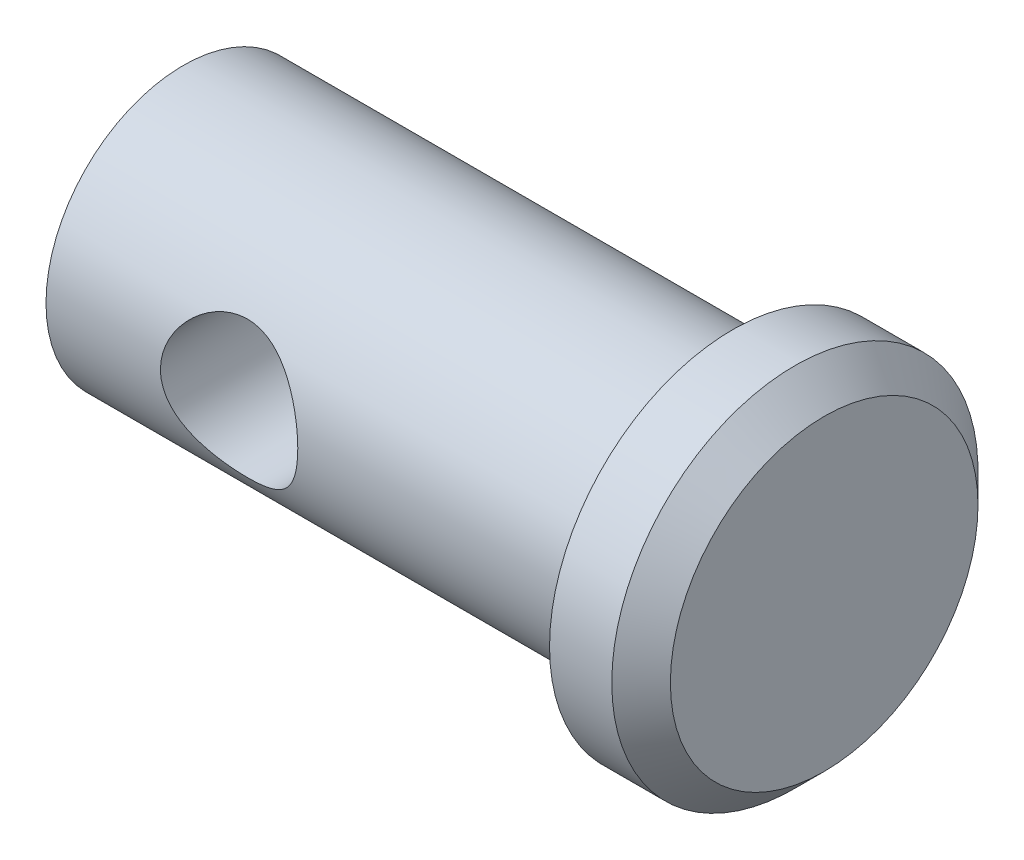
ISO-10303-21;
HEADER;
FILE_DESCRIPTION(('STEP AP214'),'2;1');
FILE_NAME('part.step','',(''),(''),'','','');
FILE_SCHEMA(('AUTOMOTIVE_DESIGN { 1 0 10303 214 1 1 1 1 }'));
ENDSEC;
DATA;
#1=APPLICATION_CONTEXT('core data for automotive mechanical design processes');
#2=APPLICATION_PROTOCOL_DEFINITION('international standard','automotive_design',2000,#1);
#3=PRODUCT_CONTEXT('',#1,'mechanical');
#4=PRODUCT('Part','Part','',(#3));
#5=PRODUCT_RELATED_PRODUCT_CATEGORY('part','',(#4));
#6=PRODUCT_DEFINITION_FORMATION('','',#4);
#7=PRODUCT_DEFINITION_CONTEXT('part definition',#1,'design');
#8=PRODUCT_DEFINITION('design','',#6,#7);
#9=PRODUCT_DEFINITION_SHAPE('','',#8);
#10=(LENGTH_UNIT() NAMED_UNIT(*) SI_UNIT(.MILLI.,.METRE.));
#11=(NAMED_UNIT(*) PLANE_ANGLE_UNIT() SI_UNIT($,.RADIAN.));
#12=(NAMED_UNIT(*) SI_UNIT($,.STERADIAN.) SOLID_ANGLE_UNIT());
#13=UNCERTAINTY_MEASURE_WITH_UNIT(LENGTH_MEASURE(1.E-05),#10,'distance_accuracy_value','');
#14=(GEOMETRIC_REPRESENTATION_CONTEXT(3) GLOBAL_UNCERTAINTY_ASSIGNED_CONTEXT((#13)) GLOBAL_UNIT_ASSIGNED_CONTEXT((#10,
#11,#12)) REPRESENTATION_CONTEXT('',''));
#15=CARTESIAN_POINT('',(0.,0.,0.));
#16=DIRECTION('',(0.,0.,1.));
#17=DIRECTION('',(1.,0.,0.));
#18=AXIS2_PLACEMENT_3D('',#15,#16,#17);
#19=CARTESIAN_POINT('',(0.,0.,0.));
#20=DIRECTION('',(1.,0.,0.));
#21=DIRECTION('',(0.,0.,-1.));
#22=AXIS2_PLACEMENT_3D('',#19,#20,#21);
#23=PLANE('',#22);
#24=CARTESIAN_POINT('',(0.,0.,0.));
#25=DIRECTION('',(-1.,0.,0.));
#26=DIRECTION('',(0.,0.,1.));
#27=AXIS2_PLACEMENT_3D('',#24,#25,#26);
#28=CIRCLE('',#27,2.38125);
#29=CARTESIAN_POINT('',(0.,0.,2.38125));
#30=VERTEX_POINT('',#29);
#31=EDGE_CURVE('E47',#30,#30,#28,.T.);
#32=ORIENTED_EDGE('',*,*,#31,.T.);
#33=EDGE_LOOP('',(#32));
#34=FACE_BOUND('',#33,.T.);
#35=ADVANCED_FACE('F32',(#34),#23,.F.);
#36=CARTESIAN_POINT('',(0.,0.,0.));
#37=DIRECTION('',(-1.,0.,0.));
#38=DIRECTION('',(0.,0.,1.));
#39=AXIS2_PLACEMENT_3D('',#36,#37,#38);
#40=CYLINDRICAL_SURFACE('',#39,2.38125);
#41=CARTESIAN_POINT('',(4.365625,0.,2.38125));
#42=CARTESIAN_POINT('',(4.36562106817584,-0.0625934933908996,2.38124658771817));
#43=CARTESIAN_POINT('',(4.36066000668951,-0.12526160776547,2.37875553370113));
#44=CARTESIAN_POINT('',(4.34103516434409,-0.248745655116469,2.36903604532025));
#45=CARTESIAN_POINT('',(4.32635295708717,-0.309557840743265,2.36179861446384));
#46=CARTESIAN_POINT('',(4.28800362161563,-0.427355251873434,2.34334382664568));
#47=CARTESIAN_POINT('',(4.26437141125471,-0.484354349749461,2.33214194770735));
#48=CARTESIAN_POINT('',(4.20897372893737,-0.593493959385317,2.30678565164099));
#49=CARTESIAN_POINT('',(4.17720889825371,-0.645634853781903,2.29263146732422));
#50=CARTESIAN_POINT('',(4.10426227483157,-0.747126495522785,2.26166669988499));
#51=CARTESIAN_POINT('',(4.0626270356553,-0.796117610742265,2.24474721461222));
#52=CARTESIAN_POINT('',(3.9720978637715,-0.886753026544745,2.2105140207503));
#53=CARTESIAN_POINT('',(3.92319845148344,-0.928391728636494,2.19320002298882));
#54=CARTESIAN_POINT('',(3.81498076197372,-1.00637816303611,2.15859063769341));
#55=CARTESIAN_POINT('',(3.7551485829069,-1.04206516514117,2.14140081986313));
#56=CARTESIAN_POINT('',(3.62938139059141,-1.10271904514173,2.11081118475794));
#57=CARTESIAN_POINT('',(3.56345077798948,-1.12769358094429,2.09740866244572));
#58=CARTESIAN_POINT('',(3.43138310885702,-1.16458893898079,2.07713897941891));
#59=CARTESIAN_POINT('',(3.36549469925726,-1.1772017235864,2.06992860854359));
#60=CARTESIAN_POINT('',(3.23217519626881,-1.19113338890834,2.06194687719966));
#61=CARTESIAN_POINT('',(3.16474569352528,-1.19246343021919,2.06116915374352));
#62=CARTESIAN_POINT('',(3.03892820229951,-1.18429955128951,2.06586451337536));
#63=CARTESIAN_POINT('',(2.98042326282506,-1.17608099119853,2.07060121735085));
#64=CARTESIAN_POINT('',(2.86576860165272,-1.15126275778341,2.0845013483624));
#65=CARTESIAN_POINT('',(2.80961963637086,-1.13466041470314,2.09366618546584));
#66=CARTESIAN_POINT('',(2.69966781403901,-1.09324351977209,2.1155915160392));
#67=CARTESIAN_POINT('',(2.64595006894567,-1.06824668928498,2.12843079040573));
#68=CARTESIAN_POINT('',(2.54321354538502,-1.01089025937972,2.15626240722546));
#69=CARTESIAN_POINT('',(2.49419689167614,-0.97852735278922,2.17125571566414));
#70=CARTESIAN_POINT('',(2.3957106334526,-0.902572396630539,2.204003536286));
#71=CARTESIAN_POINT('',(2.34697165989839,-0.858076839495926,2.22186710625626));
#72=CARTESIAN_POINT('',(2.25734314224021,-0.761470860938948,2.25680138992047));
#73=CARTESIAN_POINT('',(2.21645734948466,-0.709356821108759,2.27387172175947));
#74=CARTESIAN_POINT('',(2.14191175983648,-0.595927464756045,2.30626428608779));
#75=CARTESIAN_POINT('',(2.10867568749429,-0.534297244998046,2.3214685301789));
#76=CARTESIAN_POINT('',(2.05331572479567,-0.405367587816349,2.34741102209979));
#77=CARTESIAN_POINT('',(2.03118301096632,-0.338072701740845,2.35815281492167));
#78=CARTESIAN_POINT('',(2.00047772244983,-0.205700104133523,2.37320534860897));
#79=CARTESIAN_POINT('',(1.99093387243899,-0.140900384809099,2.37797504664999));
#80=CARTESIAN_POINT('',(1.982631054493,-0.0104532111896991,2.38211931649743));
#81=CARTESIAN_POINT('',(1.98386697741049,0.0551938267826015,2.38149644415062));
#82=CARTESIAN_POINT('',(1.99652733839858,0.180061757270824,2.37519200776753));
#83=CARTESIAN_POINT('',(2.00715467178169,0.239386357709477,2.36990626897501));
#84=CARTESIAN_POINT('',(2.03704595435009,0.35529070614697,2.35532022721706));
#85=CARTESIAN_POINT('',(2.05631085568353,0.411870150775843,2.34601948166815));
#86=CARTESIAN_POINT('',(2.103435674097,0.522551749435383,2.323912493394));
#87=CARTESIAN_POINT('',(2.13152559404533,0.576536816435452,2.31101362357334));
#88=CARTESIAN_POINT('',(2.19524365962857,0.679205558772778,2.28295169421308));
#89=CARTESIAN_POINT('',(2.2308750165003,0.727886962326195,2.26778767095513));
#90=CARTESIAN_POINT('',(2.31270225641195,0.823635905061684,2.23490101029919));
#91=CARTESIAN_POINT('',(2.35959197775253,0.870075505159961,2.21707334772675));
#92=CARTESIAN_POINT('',(2.46053588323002,0.954710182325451,2.18196785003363));
#93=CARTESIAN_POINT('',(2.51459498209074,0.992899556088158,2.1646904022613));
#94=CARTESIAN_POINT('',(2.63165072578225,1.06168973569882,2.13182825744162));
#95=CARTESIAN_POINT('',(2.69495341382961,1.0918334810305,2.11636605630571));
#96=CARTESIAN_POINT('',(2.82675417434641,1.14071736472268,2.090428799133));
#97=CARTESIAN_POINT('',(2.89524542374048,1.15947219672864,2.07994732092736));
#98=CARTESIAN_POINT('',(3.02844623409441,1.18331657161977,2.06646662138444));
#99=CARTESIAN_POINT('',(3.09288765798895,1.18954509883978,2.06284572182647));
#100=CARTESIAN_POINT('',(3.22196666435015,1.19144552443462,2.06175000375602));
#101=CARTESIAN_POINT('',(3.28660414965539,1.18712199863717,2.06427252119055));
#102=CARTESIAN_POINT('',(3.40774754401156,1.16910579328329,2.07451954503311));
#103=CARTESIAN_POINT('',(3.46444149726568,1.1563448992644,2.081725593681));
#104=CARTESIAN_POINT('',(3.57482154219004,1.12296816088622,2.09991741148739));
#105=CARTESIAN_POINT('',(3.62850665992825,1.10234978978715,2.11090439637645));
#106=CARTESIAN_POINT('',(3.73533771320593,1.05229312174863,2.13632093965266));
#107=CARTESIAN_POINT('',(3.78820509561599,1.02235532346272,2.15093219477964));
#108=CARTESIAN_POINT('',(3.88851124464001,0.955061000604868,2.18164566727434));
#109=CARTESIAN_POINT('',(3.93594716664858,0.917700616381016,2.19774865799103));
#110=CARTESIAN_POINT('',(4.03003779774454,0.831298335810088,2.23197328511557));
#111=CARTESIAN_POINT('',(4.07589724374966,0.781388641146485,2.25010245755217));
#112=CARTESIAN_POINT('',(4.15876936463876,0.67407806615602,2.28454448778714));
#113=CARTESIAN_POINT('',(4.19577727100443,0.616673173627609,2.30085636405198));
#114=CARTESIAN_POINT('',(4.25994079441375,0.495218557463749,2.33002942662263));
#115=CARTESIAN_POINT('',(4.28702490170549,0.43112472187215,2.34286539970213));
#116=CARTESIAN_POINT('',(4.3296778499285,0.298539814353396,2.36340659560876));
#117=CARTESIAN_POINT('',(4.34527941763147,0.230061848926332,2.37112639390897));
#118=CARTESIAN_POINT('',(4.35835910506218,0.134066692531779,2.37762409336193));
#119=CARTESIAN_POINT('',(4.36107995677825,0.107348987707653,2.37898025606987));
#120=CARTESIAN_POINT('',(4.36471377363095,0.0537587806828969,2.3807939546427));
#121=CARTESIAN_POINT('',(4.36562668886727,0.0268862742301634,2.38125146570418));
#122=CARTESIAN_POINT('',(4.365625,0.,2.38125));
#123=B_SPLINE_CURVE_WITH_KNOTS('',3,(#41,#42,#43,#44,#45,#46,#47,#48,#49,#50,#51,#52,#53,#54,
#55,#56,#57,#58,#59,#60,#61,#62,#63,#64,#65,#66,#67,#68,#69,#70,#71,#72,#73,#74,#75,#76,#77,#78,
#79,#80,#81,#82,#83,#84,#85,#86,#87,#88,#89,#90,#91,#92,#93,#94,#95,#96,#97,#98,#99,#100,#101,
#102,#103,#104,#105,#106,#107,#108,#109,#110,#111,#112,#113,#114,#115,#116,#117,#118,#119,#120,
#121,#122),.UNSPECIFIED.,.T.,.F.,(4,2,2,2,2,2,2,2,2,2,2,2,2,2,2,2,2,2,2,2,2,2,2,2,2,2,2,2,2,2,2,
2,2,2,2,2,2,2,2,2,4),(0.,0.187671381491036,0.375699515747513,0.563001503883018,
0.750288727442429,0.948906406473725,1.14767467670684,1.36185743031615,1.57588681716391,
1.77710320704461,1.97812053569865,2.15509926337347,2.33213438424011,2.51329317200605,
2.69453345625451,2.89875445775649,3.10307277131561,3.31687910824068,3.53051527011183,
3.72645730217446,3.92230647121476,4.10297598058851,4.28366541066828,4.46952119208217,
4.65545627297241,4.85965036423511,5.06398516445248,5.27821543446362,5.49216872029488,
5.68558331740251,5.87891405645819,6.0538272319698,6.22879670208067,6.41552156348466,
6.60234377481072,6.81186617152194,7.02150118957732,7.2326184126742,7.44313156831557,
7.52374130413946,7.60435326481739),.UNSPECIFIED.);
#124=CARTESIAN_POINT('',(4.365625,0.,2.38125));
#125=VERTEX_POINT('',#124);
#126=EDGE_CURVE('E35',#125,#125,#123,.T.);
#127=ORIENTED_EDGE('',*,*,#126,.T.);
#128=EDGE_LOOP('',(#127));
#129=FACE_BOUND('',#128,.T.);
#130=CARTESIAN_POINT('',(4.365625,0.,-2.38125));
#131=CARTESIAN_POINT('',(4.36562106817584,0.0625934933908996,-2.38124658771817));
#132=CARTESIAN_POINT('',(4.36066000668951,0.12526160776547,-2.37875553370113));
#133=CARTESIAN_POINT('',(4.34103516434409,0.248745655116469,-2.36903604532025));
#134=CARTESIAN_POINT('',(4.32635295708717,0.309557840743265,-2.36179861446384));
#135=CARTESIAN_POINT('',(4.28800362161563,0.427355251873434,-2.34334382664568));
#136=CARTESIAN_POINT('',(4.26437141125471,0.484354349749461,-2.33214194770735));
#137=CARTESIAN_POINT('',(4.20897372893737,0.593493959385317,-2.30678565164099));
#138=CARTESIAN_POINT('',(4.17720889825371,0.645634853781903,-2.29263146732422));
#139=CARTESIAN_POINT('',(4.10426227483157,0.747126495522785,-2.26166669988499));
#140=CARTESIAN_POINT('',(4.0626270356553,0.796117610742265,-2.24474721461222));
#141=CARTESIAN_POINT('',(3.9720978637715,0.886753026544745,-2.2105140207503));
#142=CARTESIAN_POINT('',(3.92319845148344,0.928391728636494,-2.19320002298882));
#143=CARTESIAN_POINT('',(3.81498076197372,1.00637816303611,-2.15859063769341));
#144=CARTESIAN_POINT('',(3.7551485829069,1.04206516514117,-2.14140081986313));
#145=CARTESIAN_POINT('',(3.62938139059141,1.10271904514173,-2.11081118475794));
#146=CARTESIAN_POINT('',(3.56345077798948,1.12769358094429,-2.09740866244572));
#147=CARTESIAN_POINT('',(3.43138310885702,1.16458893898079,-2.07713897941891));
#148=CARTESIAN_POINT('',(3.36549469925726,1.1772017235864,-2.06992860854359));
#149=CARTESIAN_POINT('',(3.23217519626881,1.19113338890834,-2.06194687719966));
#150=CARTESIAN_POINT('',(3.16474569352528,1.19246343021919,-2.06116915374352));
#151=CARTESIAN_POINT('',(3.03892820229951,1.18429955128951,-2.06586451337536));
#152=CARTESIAN_POINT('',(2.98042326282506,1.17608099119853,-2.07060121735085));
#153=CARTESIAN_POINT('',(2.86576860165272,1.15126275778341,-2.0845013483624));
#154=CARTESIAN_POINT('',(2.80961963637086,1.13466041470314,-2.09366618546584));
#155=CARTESIAN_POINT('',(2.69966781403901,1.09324351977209,-2.1155915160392));
#156=CARTESIAN_POINT('',(2.64595006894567,1.06824668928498,-2.12843079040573));
#157=CARTESIAN_POINT('',(2.54321354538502,1.01089025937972,-2.15626240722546));
#158=CARTESIAN_POINT('',(2.49419689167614,0.97852735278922,-2.17125571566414));
#159=CARTESIAN_POINT('',(2.3957106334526,0.902572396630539,-2.204003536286));
#160=CARTESIAN_POINT('',(2.34697165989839,0.858076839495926,-2.22186710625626));
#161=CARTESIAN_POINT('',(2.25734314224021,0.761470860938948,-2.25680138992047));
#162=CARTESIAN_POINT('',(2.21645734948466,0.709356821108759,-2.27387172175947));
#163=CARTESIAN_POINT('',(2.14191175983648,0.595927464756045,-2.30626428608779));
#164=CARTESIAN_POINT('',(2.10867568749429,0.534297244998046,-2.3214685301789));
#165=CARTESIAN_POINT('',(2.05331572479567,0.405367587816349,-2.34741102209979));
#166=CARTESIAN_POINT('',(2.03118301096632,0.338072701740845,-2.35815281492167));
#167=CARTESIAN_POINT('',(2.00047772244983,0.205700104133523,-2.37320534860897));
#168=CARTESIAN_POINT('',(1.99093387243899,0.140900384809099,-2.37797504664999));
#169=CARTESIAN_POINT('',(1.982631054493,0.0104532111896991,-2.38211931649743));
#170=CARTESIAN_POINT('',(1.98386697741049,-0.0551938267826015,-2.38149644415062));
#171=CARTESIAN_POINT('',(1.99652733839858,-0.180061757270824,-2.37519200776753));
#172=CARTESIAN_POINT('',(2.00715467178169,-0.239386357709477,-2.36990626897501));
#173=CARTESIAN_POINT('',(2.03704595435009,-0.35529070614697,-2.35532022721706));
#174=CARTESIAN_POINT('',(2.05631085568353,-0.411870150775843,-2.34601948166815));
#175=CARTESIAN_POINT('',(2.103435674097,-0.522551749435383,-2.323912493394));
#176=CARTESIAN_POINT('',(2.13152559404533,-0.576536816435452,-2.31101362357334));
#177=CARTESIAN_POINT('',(2.19524365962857,-0.679205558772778,-2.28295169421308));
#178=CARTESIAN_POINT('',(2.2308750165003,-0.727886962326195,-2.26778767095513));
#179=CARTESIAN_POINT('',(2.31270225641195,-0.823635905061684,-2.23490101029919));
#180=CARTESIAN_POINT('',(2.35959197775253,-0.870075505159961,-2.21707334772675));
#181=CARTESIAN_POINT('',(2.46053588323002,-0.954710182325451,-2.18196785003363));
#182=CARTESIAN_POINT('',(2.51459498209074,-0.992899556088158,-2.1646904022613));
#183=CARTESIAN_POINT('',(2.63165072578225,-1.06168973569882,-2.13182825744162));
#184=CARTESIAN_POINT('',(2.69495341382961,-1.0918334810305,-2.11636605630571));
#185=CARTESIAN_POINT('',(2.82675417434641,-1.14071736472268,-2.090428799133));
#186=CARTESIAN_POINT('',(2.89524542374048,-1.15947219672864,-2.07994732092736));
#187=CARTESIAN_POINT('',(3.02844623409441,-1.18331657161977,-2.06646662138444));
#188=CARTESIAN_POINT('',(3.09288765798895,-1.18954509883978,-2.06284572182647));
#189=CARTESIAN_POINT('',(3.22196666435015,-1.19144552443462,-2.06175000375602));
#190=CARTESIAN_POINT('',(3.28660414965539,-1.18712199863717,-2.06427252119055));
#191=CARTESIAN_POINT('',(3.40774754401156,-1.16910579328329,-2.07451954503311));
#192=CARTESIAN_POINT('',(3.46444149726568,-1.1563448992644,-2.081725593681));
#193=CARTESIAN_POINT('',(3.57482154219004,-1.12296816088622,-2.09991741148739));
#194=CARTESIAN_POINT('',(3.62850665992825,-1.10234978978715,-2.11090439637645));
#195=CARTESIAN_POINT('',(3.73533771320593,-1.05229312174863,-2.13632093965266));
#196=CARTESIAN_POINT('',(3.78820509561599,-1.02235532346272,-2.15093219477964));
#197=CARTESIAN_POINT('',(3.88851124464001,-0.955061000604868,-2.18164566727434));
#198=CARTESIAN_POINT('',(3.93594716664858,-0.917700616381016,-2.19774865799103));
#199=CARTESIAN_POINT('',(4.03003779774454,-0.831298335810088,-2.23197328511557));
#200=CARTESIAN_POINT('',(4.07589724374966,-0.781388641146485,-2.25010245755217));
#201=CARTESIAN_POINT('',(4.15876936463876,-0.67407806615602,-2.28454448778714));
#202=CARTESIAN_POINT('',(4.19577727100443,-0.616673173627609,-2.30085636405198));
#203=CARTESIAN_POINT('',(4.25994079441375,-0.495218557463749,-2.33002942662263));
#204=CARTESIAN_POINT('',(4.28702490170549,-0.43112472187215,-2.34286539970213));
#205=CARTESIAN_POINT('',(4.3296778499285,-0.298539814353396,-2.36340659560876));
#206=CARTESIAN_POINT('',(4.34527941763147,-0.230061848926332,-2.37112639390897));
#207=CARTESIAN_POINT('',(4.35835910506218,-0.134066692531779,-2.37762409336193));
#208=CARTESIAN_POINT('',(4.36107995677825,-0.107348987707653,-2.37898025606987));
#209=CARTESIAN_POINT('',(4.36471377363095,-0.0537587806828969,-2.3807939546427));
#210=CARTESIAN_POINT('',(4.36562668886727,-0.0268862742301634,-2.38125146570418));
#211=CARTESIAN_POINT('',(4.365625,0.,-2.38125));
#212=B_SPLINE_CURVE_WITH_KNOTS('',3,(#130,#131,#132,#133,#134,#135,#136,#137,#138,#139,#140,
#141,#142,#143,#144,#145,#146,#147,#148,#149,#150,#151,#152,#153,#154,#155,#156,#157,#158,#159,
#160,#161,#162,#163,#164,#165,#166,#167,#168,#169,#170,#171,#172,#173,#174,#175,#176,#177,#178,
#179,#180,#181,#182,#183,#184,#185,#186,#187,#188,#189,#190,#191,#192,#193,#194,#195,#196,#197,
#198,#199,#200,#201,#202,#203,#204,#205,#206,#207,#208,#209,#210,#211),.UNSPECIFIED.,.T.,.F.,(4,
2,2,2,2,2,2,2,2,2,2,2,2,2,2,2,2,2,2,2,2,2,2,2,2,2,2,2,2,2,2,2,2,2,2,2,2,2,2,2,4),(0.,
0.187671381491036,0.375699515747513,0.563001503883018,0.750288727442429,0.948906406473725,
1.14767467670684,1.36185743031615,1.57588681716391,1.77710320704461,1.97812053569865,
2.15509926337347,2.33213438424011,2.51329317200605,2.69453345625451,2.89875445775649,
3.10307277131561,3.31687910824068,3.53051527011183,3.72645730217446,3.92230647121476,
4.10297598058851,4.28366541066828,4.46952119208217,4.65545627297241,4.85965036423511,
5.06398516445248,5.27821543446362,5.49216872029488,5.68558331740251,5.87891405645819,
6.0538272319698,6.22879670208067,6.41552156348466,6.60234377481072,6.81186617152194,
7.02150118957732,7.2326184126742,7.44313156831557,7.52374130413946,7.60435326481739),.UNSPECIFIED.);
#213=CARTESIAN_POINT('',(4.365625,0.,-2.38125));
#214=VERTEX_POINT('',#213);
#215=EDGE_CURVE('E50',#214,#214,#212,.T.);
#216=ORIENTED_EDGE('',*,*,#215,.T.);
#217=EDGE_LOOP('',(#216));
#218=FACE_BOUND('',#217,.T.);
#219=ORIENTED_EDGE('',*,*,#31,.F.);
#220=EDGE_LOOP('',(#219));
#221=FACE_BOUND('',#220,.T.);
#222=CARTESIAN_POINT('',(9.525,0.,0.));
#223=DIRECTION('',(-1.,0.,0.));
#224=DIRECTION('',(0.,0.,1.));
#225=AXIS2_PLACEMENT_3D('',#222,#223,#224);
#226=CIRCLE('',#225,2.38125);
#227=CARTESIAN_POINT('',(9.525,0.,2.38125));
#228=VERTEX_POINT('',#227);
#229=EDGE_CURVE('E89',#228,#228,#226,.T.);
#230=ORIENTED_EDGE('',*,*,#229,.T.);
#231=EDGE_LOOP('',(#230));
#232=FACE_BOUND('',#231,.T.);
#233=ADVANCED_FACE('F54',(#129,#218,#221,#232),#40,.T.);
#234=CARTESIAN_POINT('',(9.525,2.38125,0.));
#235=DIRECTION('',(1.,0.,0.));
#236=DIRECTION('',(0.,0.,-1.));
#237=AXIS2_PLACEMENT_3D('',#234,#235,#236);
#238=PLANE('',#237);
#239=ORIENTED_EDGE('',*,*,#229,.F.);
#240=EDGE_LOOP('',(#239));
#241=FACE_BOUND('',#240,.T.);
#242=CARTESIAN_POINT('',(9.525,0.,0.));
#243=DIRECTION('',(-1.,0.,0.));
#244=DIRECTION('',(0.,0.,1.));
#245=AXIS2_PLACEMENT_3D('',#242,#243,#244);
#246=CIRCLE('',#245,3.175);
#247=CARTESIAN_POINT('',(9.525,0.,3.175));
#248=VERTEX_POINT('',#247);
#249=EDGE_CURVE('E91',#248,#248,#246,.T.);
#250=ORIENTED_EDGE('',*,*,#249,.T.);
#251=EDGE_LOOP('',(#250));
#252=FACE_BOUND('',#251,.T.);
#253=ADVANCED_FACE('F72',(#241,#252),#238,.F.);
#254=CARTESIAN_POINT('',(0.,0.,0.));
#255=DIRECTION('',(-1.,0.,0.));
#256=DIRECTION('',(0.,0.,1.));
#257=AXIS2_PLACEMENT_3D('',#254,#255,#256);
#258=CYLINDRICAL_SURFACE('',#257,3.175);
#259=CARTESIAN_POINT('',(10.6045,0.,0.));
#260=DIRECTION('',(-1.,0.,0.));
#261=DIRECTION('',(0.,0.,1.));
#262=AXIS2_PLACEMENT_3D('',#259,#260,#261);
#263=CIRCLE('',#262,3.175);
#264=CARTESIAN_POINT('',(10.6045,0.,3.175));
#265=VERTEX_POINT('',#264);
#266=EDGE_CURVE('E42',#265,#265,#263,.T.);
#267=ORIENTED_EDGE('',*,*,#266,.T.);
#268=EDGE_LOOP('',(#267));
#269=FACE_BOUND('',#268,.T.);
#270=ORIENTED_EDGE('',*,*,#249,.F.);
#271=EDGE_LOOP('',(#270));
#272=FACE_BOUND('',#271,.T.);
#273=ADVANCED_FACE('F70',(#269,#272),#258,.T.);
#274=CARTESIAN_POINT('',(11.1125,3.175,0.));
#275=DIRECTION('',(-1.,0.,0.));
#276=DIRECTION('',(0.,0.,1.));
#277=AXIS2_PLACEMENT_3D('',#274,#275,#276);
#278=PLANE('',#277);
#279=CARTESIAN_POINT('',(11.1125,0.,0.));
#280=DIRECTION('',(-1.,0.,0.));
#281=DIRECTION('',(0.,0.,1.));
#282=AXIS2_PLACEMENT_3D('',#279,#280,#281);
#283=CIRCLE('',#282,2.667);
#284=CARTESIAN_POINT('',(11.1125,0.,2.667));
#285=VERTEX_POINT('',#284);
#286=EDGE_CURVE('E10',#285,#285,#283,.F.);
#287=ORIENTED_EDGE('',*,*,#286,.T.);
#288=EDGE_LOOP('',(#287));
#289=FACE_BOUND('',#288,.T.);
#290=ADVANCED_FACE('F66',(#289),#278,.F.);
#291=CARTESIAN_POINT('',(10.6045,0.,0.));
#292=DIRECTION('',(-1.,0.,0.));
#293=DIRECTION('',(0.,0.,1.));
#294=AXIS2_PLACEMENT_3D('',#291,#292,#293);
#295=CONICAL_SURFACE('',#294,3.175,0.785398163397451);
#296=ORIENTED_EDGE('',*,*,#286,.F.);
#297=EDGE_LOOP('',(#296));
#298=FACE_BOUND('',#297,.T.);
#299=ORIENTED_EDGE('',*,*,#266,.F.);
#300=EDGE_LOOP('',(#299));
#301=FACE_BOUND('',#300,.T.);
#302=ADVANCED_FACE('F61',(#298,#301),#295,.T.);
#303=CARTESIAN_POINT('',(3.175,0.,-3.175));
#304=DIRECTION('',(0.,0.,1.));
#305=DIRECTION('',(1.,0.,0.));
#306=AXIS2_PLACEMENT_3D('',#303,#304,#305);
#307=CYLINDRICAL_SURFACE('',#306,1.190625);
#308=ORIENTED_EDGE('',*,*,#215,.F.);
#309=EDGE_LOOP('',(#308));
#310=FACE_BOUND('',#309,.T.);
#311=ORIENTED_EDGE('',*,*,#126,.F.);
#312=EDGE_LOOP('',(#311));
#313=FACE_BOUND('',#312,.T.);
#314=ADVANCED_FACE('F57',(#310,#313),#307,.F.);
#315=CLOSED_SHELL('',(#35,#233,#253,#273,#290,#302,#314));
#316=MANIFOLD_SOLID_BREP('B2',#315);
#317=ADVANCED_BREP_SHAPE_REPRESENTATION('',(#18,#316),#14);
#318=SHAPE_DEFINITION_REPRESENTATION(#9,#317);
ENDSEC;
END-ISO-10303-21;
